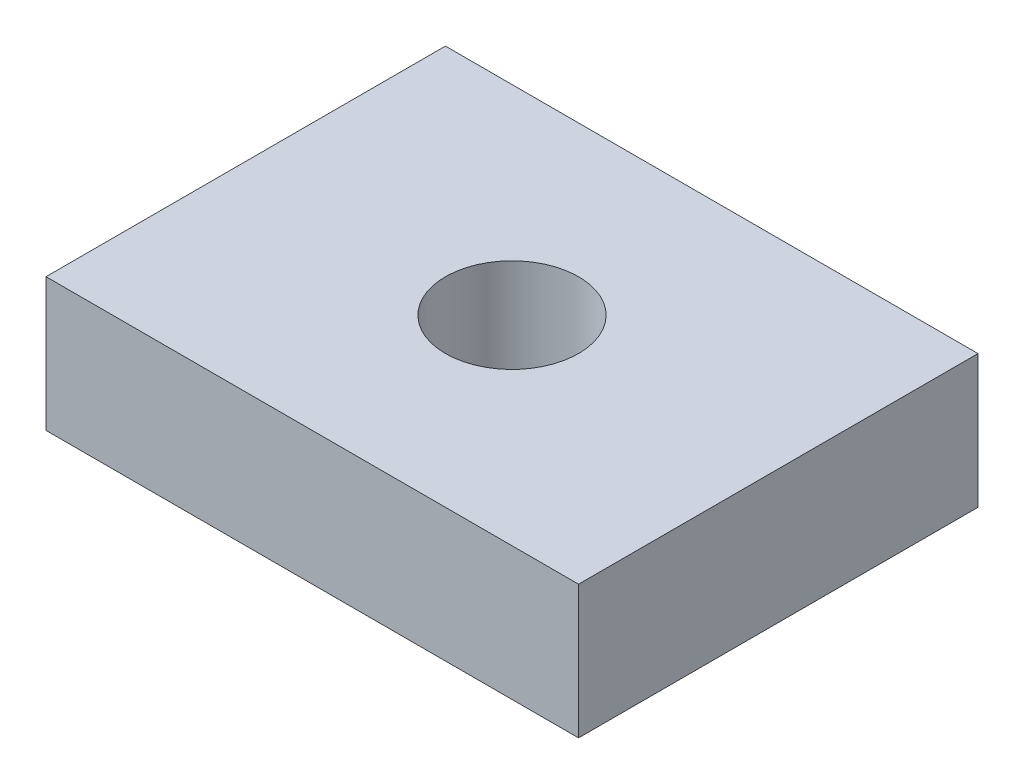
ISO-10303-21;
HEADER;
FILE_DESCRIPTION(('STEP AP214'),'2;1');
FILE_NAME('part.step','',(''),(''),'','','');
FILE_SCHEMA(('AUTOMOTIVE_DESIGN { 1 0 10303 214 1 1 1 1 }'));
ENDSEC;
DATA;
#1=APPLICATION_CONTEXT('core data for automotive mechanical design processes');
#2=APPLICATION_PROTOCOL_DEFINITION('international standard','automotive_design',2000,#1);
#3=PRODUCT_CONTEXT('',#1,'mechanical');
#4=PRODUCT('Part','Part','',(#3));
#5=PRODUCT_RELATED_PRODUCT_CATEGORY('part','',(#4));
#6=PRODUCT_DEFINITION_FORMATION('','',#4);
#7=PRODUCT_DEFINITION_CONTEXT('part definition',#1,'design');
#8=PRODUCT_DEFINITION('design','',#6,#7);
#9=PRODUCT_DEFINITION_SHAPE('','',#8);
#10=(LENGTH_UNIT() NAMED_UNIT(*) SI_UNIT(.MILLI.,.METRE.));
#11=(NAMED_UNIT(*) PLANE_ANGLE_UNIT() SI_UNIT($,.RADIAN.));
#12=(NAMED_UNIT(*) SI_UNIT($,.STERADIAN.) SOLID_ANGLE_UNIT());
#13=UNCERTAINTY_MEASURE_WITH_UNIT(LENGTH_MEASURE(1.E-05),#10,'distance_accuracy_value','');
#14=(GEOMETRIC_REPRESENTATION_CONTEXT(3) GLOBAL_UNCERTAINTY_ASSIGNED_CONTEXT((#13)) GLOBAL_UNIT_ASSIGNED_CONTEXT((#10,
#11,#12)) REPRESENTATION_CONTEXT('',''));
#15=CARTESIAN_POINT('',(0.,0.,0.));
#16=DIRECTION('',(0.,0.,1.));
#17=DIRECTION('',(1.,0.,0.));
#18=AXIS2_PLACEMENT_3D('',#15,#16,#17);
#19=CARTESIAN_POINT('',(0.,-20.,0.));
#20=DIRECTION('',(-1.,0.,0.));
#21=DIRECTION('',(0.,0.,1.));
#22=AXIS2_PLACEMENT_3D('',#19,#20,#21);
#23=PLANE('',#22);
#24=DIRECTION('',(0.,0.,1.));
#25=VECTOR('',#24,1.);
#26=CARTESIAN_POINT('',(0.,0.,0.));
#27=LINE('',#26,#25);
#28=CARTESIAN_POINT('',(0.,0.,-60.));
#29=VERTEX_POINT('',#28);
#30=CARTESIAN_POINT('',(0.,0.,0.));
#31=VERTEX_POINT('',#30);
#32=EDGE_CURVE('E102',#29,#31,#27,.T.);
#33=ORIENTED_EDGE('',*,*,#32,.F.);
#34=DIRECTION('',(0.,1.,0.));
#35=VECTOR('',#34,1.);
#36=CARTESIAN_POINT('',(0.,-20.,-60.));
#37=LINE('',#36,#35);
#38=CARTESIAN_POINT('',(0.,-20.,-60.));
#39=VERTEX_POINT('',#38);
#40=EDGE_CURVE('E11',#39,#29,#37,.T.);
#41=ORIENTED_EDGE('',*,*,#40,.F.);
#42=DIRECTION('',(0.,0.,1.));
#43=VECTOR('',#42,1.);
#44=CARTESIAN_POINT('',(0.,-20.,0.));
#45=LINE('',#44,#43);
#46=CARTESIAN_POINT('',(0.,-20.,0.));
#47=VERTEX_POINT('',#46);
#48=EDGE_CURVE('E100',#39,#47,#45,.T.);
#49=ORIENTED_EDGE('',*,*,#48,.T.);
#50=DIRECTION('',(0.,1.,0.));
#51=VECTOR('',#50,1.);
#52=CARTESIAN_POINT('',(0.,-20.,0.));
#53=LINE('',#52,#51);
#54=EDGE_CURVE('E45',#47,#31,#53,.T.);
#55=ORIENTED_EDGE('',*,*,#54,.T.);
#56=EDGE_LOOP('',(#33,#41,#49,#55));
#57=FACE_BOUND('',#56,.T.);
#58=ADVANCED_FACE('F39',(#57),#23,.T.);
#59=CARTESIAN_POINT('',(0.,-20.,-60.));
#60=DIRECTION('',(0.,0.,-1.));
#61=DIRECTION('',(-1.,0.,0.));
#62=AXIS2_PLACEMENT_3D('',#59,#60,#61);
#63=PLANE('',#62);
#64=DIRECTION('',(-1.,0.,0.));
#65=VECTOR('',#64,1.);
#66=CARTESIAN_POINT('',(0.,0.,-60.));
#67=LINE('',#66,#65);
#68=CARTESIAN_POINT('',(80.,0.,-60.));
#69=VERTEX_POINT('',#68);
#70=EDGE_CURVE('E97',#69,#29,#67,.T.);
#71=ORIENTED_EDGE('',*,*,#70,.F.);
#72=DIRECTION('',(0.,1.,0.));
#73=VECTOR('',#72,1.);
#74=CARTESIAN_POINT('',(80.,-20.,-60.));
#75=LINE('',#74,#73);
#76=CARTESIAN_POINT('',(80.,-20.,-60.));
#77=VERTEX_POINT('',#76);
#78=EDGE_CURVE('E48',#77,#69,#75,.T.);
#79=ORIENTED_EDGE('',*,*,#78,.F.);
#80=DIRECTION('',(-1.,0.,0.));
#81=VECTOR('',#80,1.);
#82=CARTESIAN_POINT('',(0.,-20.,-60.));
#83=LINE('',#82,#81);
#84=EDGE_CURVE('E94',#77,#39,#83,.T.);
#85=ORIENTED_EDGE('',*,*,#84,.T.);
#86=ORIENTED_EDGE('',*,*,#40,.T.);
#87=EDGE_LOOP('',(#71,#79,#85,#86));
#88=FACE_BOUND('',#87,.T.);
#89=ADVANCED_FACE('F113',(#88),#63,.T.);
#90=CARTESIAN_POINT('',(80.,-20.,0.));
#91=DIRECTION('',(1.,0.,0.));
#92=DIRECTION('',(0.,0.,-1.));
#93=AXIS2_PLACEMENT_3D('',#90,#91,#92);
#94=PLANE('',#93);
#95=DIRECTION('',(0.,0.,-1.));
#96=VECTOR('',#95,1.);
#97=CARTESIAN_POINT('',(80.,0.,0.));
#98=LINE('',#97,#96);
#99=CARTESIAN_POINT('',(80.,0.,0.));
#100=VERTEX_POINT('',#99);
#101=EDGE_CURVE('E90',#100,#69,#98,.T.);
#102=ORIENTED_EDGE('',*,*,#101,.F.);
#103=DIRECTION('',(0.,1.,0.));
#104=VECTOR('',#103,1.);
#105=CARTESIAN_POINT('',(80.,-20.,0.));
#106=LINE('',#105,#104);
#107=CARTESIAN_POINT('',(80.,-20.,0.));
#108=VERTEX_POINT('',#107);
#109=EDGE_CURVE('E82',#108,#100,#106,.T.);
#110=ORIENTED_EDGE('',*,*,#109,.F.);
#111=DIRECTION('',(0.,0.,-1.));
#112=VECTOR('',#111,1.);
#113=CARTESIAN_POINT('',(80.,-20.,0.));
#114=LINE('',#113,#112);
#115=EDGE_CURVE('E87',#108,#77,#114,.T.);
#116=ORIENTED_EDGE('',*,*,#115,.T.);
#117=ORIENTED_EDGE('',*,*,#78,.T.);
#118=EDGE_LOOP('',(#102,#110,#116,#117));
#119=FACE_BOUND('',#118,.T.);
#120=ADVANCED_FACE('F88',(#119),#94,.T.);
#121=CARTESIAN_POINT('',(0.,-20.,0.));
#122=DIRECTION('',(0.,0.,1.));
#123=DIRECTION('',(1.,0.,0.));
#124=AXIS2_PLACEMENT_3D('',#121,#122,#123);
#125=PLANE('',#124);
#126=DIRECTION('',(1.,0.,0.));
#127=VECTOR('',#126,1.);
#128=CARTESIAN_POINT('',(0.,0.,0.));
#129=LINE('',#128,#127);
#130=EDGE_CURVE('E110',#31,#100,#129,.T.);
#131=ORIENTED_EDGE('',*,*,#130,.F.);
#132=ORIENTED_EDGE('',*,*,#54,.F.);
#133=DIRECTION('',(1.,0.,0.));
#134=VECTOR('',#133,1.);
#135=CARTESIAN_POINT('',(0.,-20.,0.));
#136=LINE('',#135,#134);
#137=EDGE_CURVE('E91',#47,#108,#136,.T.);
#138=ORIENTED_EDGE('',*,*,#137,.T.);
#139=ORIENTED_EDGE('',*,*,#109,.T.);
#140=EDGE_LOOP('',(#131,#132,#138,#139));
#141=FACE_BOUND('',#140,.T.);
#142=ADVANCED_FACE('F96',(#141),#125,.T.);
#143=CARTESIAN_POINT('',(0.,-20.,0.));
#144=DIRECTION('',(0.,-1.,0.));
#145=DIRECTION('',(0.,0.,-1.));
#146=AXIS2_PLACEMENT_3D('',#143,#144,#145);
#147=PLANE('',#146);
#148=CARTESIAN_POINT('',(40.,-20.,-30.));
#149=DIRECTION('',(0.,1.,0.));
#150=DIRECTION('',(0.,0.,1.));
#151=AXIS2_PLACEMENT_3D('',#148,#149,#150);
#152=CIRCLE('',#151,10.);
#153=CARTESIAN_POINT('',(40.,-20.,-20.));
#154=VERTEX_POINT('',#153);
#155=EDGE_CURVE('E107',#154,#154,#152,.T.);
#156=ORIENTED_EDGE('',*,*,#155,.T.);
#157=EDGE_LOOP('',(#156));
#158=FACE_BOUND('',#157,.T.);
#159=ORIENTED_EDGE('',*,*,#48,.F.);
#160=ORIENTED_EDGE('',*,*,#84,.F.);
#161=ORIENTED_EDGE('',*,*,#115,.F.);
#162=ORIENTED_EDGE('',*,*,#137,.F.);
#163=EDGE_LOOP('',(#159,#160,#161,#162));
#164=FACE_BOUND('',#163,.T.);
#165=ADVANCED_FACE('F95',(#158,#164),#147,.T.);
#166=CARTESIAN_POINT('',(0.,0.,0.));
#167=DIRECTION('',(0.,-1.,0.));
#168=DIRECTION('',(0.,0.,-1.));
#169=AXIS2_PLACEMENT_3D('',#166,#167,#168);
#170=PLANE('',#169);
#171=CARTESIAN_POINT('',(40.,0.,-30.));
#172=DIRECTION('',(0.,1.,0.));
#173=DIRECTION('',(0.,0.,1.));
#174=AXIS2_PLACEMENT_3D('',#171,#172,#173);
#175=CIRCLE('',#174,10.);
#176=CARTESIAN_POINT('',(40.,0.,-20.));
#177=VERTEX_POINT('',#176);
#178=EDGE_CURVE('E144',#177,#177,#175,.T.);
#179=ORIENTED_EDGE('',*,*,#178,.F.);
#180=EDGE_LOOP('',(#179));
#181=FACE_BOUND('',#180,.T.);
#182=ORIENTED_EDGE('',*,*,#32,.T.);
#183=ORIENTED_EDGE('',*,*,#130,.T.);
#184=ORIENTED_EDGE('',*,*,#101,.T.);
#185=ORIENTED_EDGE('',*,*,#70,.T.);
#186=EDGE_LOOP('',(#182,#183,#184,#185));
#187=FACE_BOUND('',#186,.T.);
#188=ADVANCED_FACE('F111',(#181,#187),#170,.F.);
#189=CARTESIAN_POINT('',(40.,-20.,-30.));
#190=DIRECTION('',(0.,1.,0.));
#191=DIRECTION('',(0.,0.,1.));
#192=AXIS2_PLACEMENT_3D('',#189,#190,#191);
#193=CYLINDRICAL_SURFACE('',#192,10.);
#194=ORIENTED_EDGE('',*,*,#155,.F.);
#195=EDGE_LOOP('',(#194));
#196=FACE_BOUND('',#195,.T.);
#197=ORIENTED_EDGE('',*,*,#178,.T.);
#198=EDGE_LOOP('',(#197));
#199=FACE_BOUND('',#198,.T.);
#200=ADVANCED_FACE('F132',(#196,#199),#193,.F.);
#201=CLOSED_SHELL('',(#58,#89,#120,#142,#165,#188,#200));
#202=MANIFOLD_SOLID_BREP('B2',#201);
#203=ADVANCED_BREP_SHAPE_REPRESENTATION('',(#18,#202),#14);
#204=SHAPE_DEFINITION_REPRESENTATION(#9,#203);
ENDSEC;
END-ISO-10303-21;
